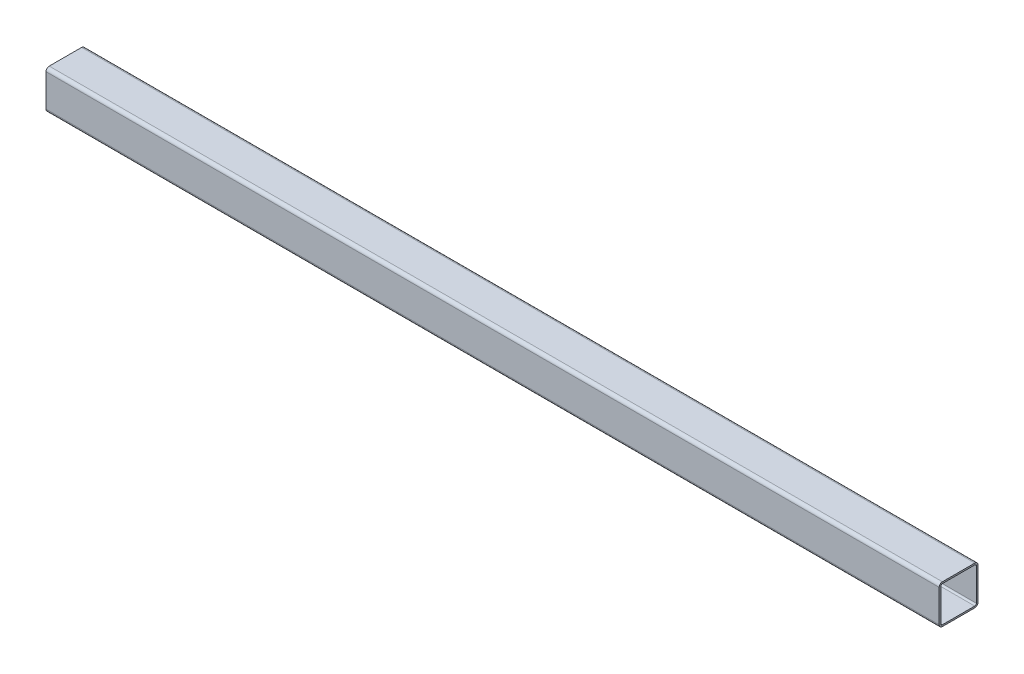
from build123d import *

# Parameters (mm, degrees)
BOSS_EXTRUDE1_DEPTH     = 7315.2
CUT_EXTRUDE1_DEPTH      = 7316.993706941
CUT_EXTRUDE1_DEPTH_BACK = 7316.993706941
SKETCH2_W               = 2510.155539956
SKETCH2_H               = 4114.8


with BuildPart() as part:
    # Sketch1 → Boss-Extrude1 (new body)
    with BuildSketch(Plane.YZ):
        with BuildLine():
            Line((-63.5, -76.2), (63.5, -76.2))
            ThreePointArc((63.5, -76.2), (72.480256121, -72.480256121), (76.2, -63.5))
            Line((76.2, -63.5), (76.2, 63.5))
            ThreePointArc((76.2, 63.5), (72.480256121, 72.480256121), (63.5, 76.2))
            Line((63.5, 76.2), (-63.5, 76.2))
            ThreePointArc((-63.5, 76.2), (-72.480256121, 72.480256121), (-76.2, 63.5))
            Line((-76.2, 63.5), (-76.2, -63.5))
            ThreePointArc((-76.2, -63.5), (-72.480256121, -72.480256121), (-63.5, -76.2))
        make_face()
        with BuildLine():
            Line((69.85, 63.5), (69.85, -63.5))
            ThreePointArc((69.85, -63.5), (67.990128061, -67.990128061), (63.5, -69.85))
            Line((63.5, -69.85), (-63.5, -69.85))
            ThreePointArc((-63.5, -69.85), (-67.990128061, -67.990128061), (-69.85, -63.5))
            Line((-69.85, -63.5), (-69.85, 63.5))
            ThreePointArc((-69.85, 63.5), (-67.990128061, 67.990128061), (-63.5, 69.85))
            Line((-63.5, 69.85), (63.5, 69.85))
            ThreePointArc((63.5, 69.85), (67.990128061, 67.990128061), (69.85, 63.5))
        make_face(mode=Mode.SUBTRACT)
    extrude(amount=BOSS_EXTRUDE1_DEPTH)

    # Sketch2 → Cut-Extrude1 (cut, two sides: drawn at the far end of the back side and taken through both)
    with BuildSketch(Plane(origin=(0, 0, 0), x_dir=(0, 1, 0), z_dir=(0, 0, 1)).offset(-CUT_EXTRUDE1_DEPTH_BACK)):
        with Locations((37.140585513, -5562.6)):
            Rectangle(SKETCH2_W, SKETCH2_H)
    extrude(amount=CUT_EXTRUDE1_DEPTH + CUT_EXTRUDE1_DEPTH_BACK, mode=Mode.SUBTRACT)


solid = part.part
